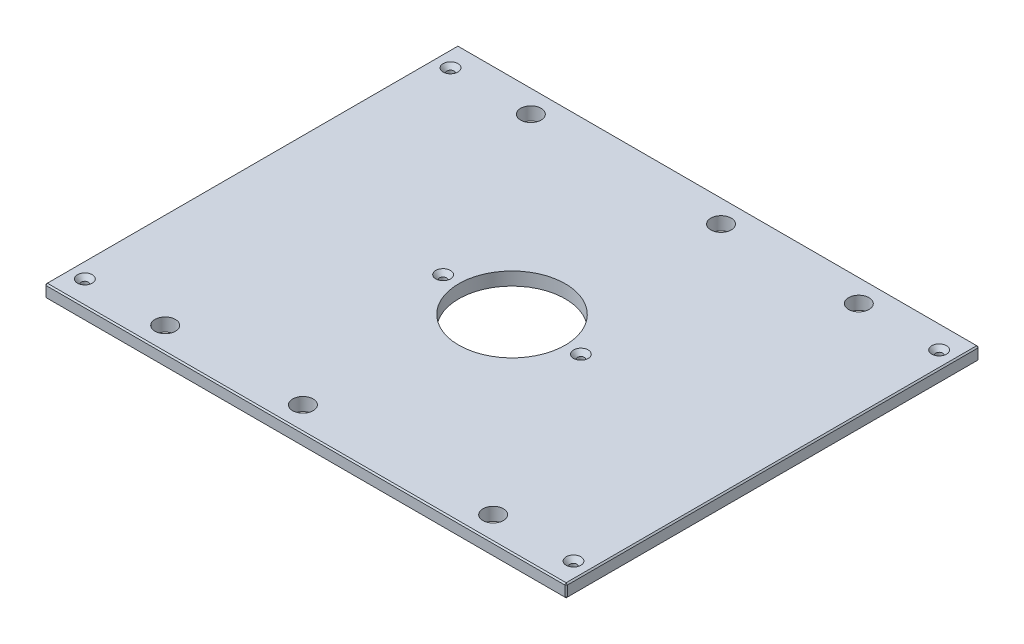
from build123d import *

# Parameters (mm, degrees)
SKETCH1_W                                        = 504.825
SKETCH1_H                                        = 400.05
BOSS_EXTRUDE1_DEPTH                              = 12.7
SKETCH13_R                                       = 51.562
CUT_EXTRUDE6_DEPTH                               = 323.309417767
F_25_32_0_78125_DIAMETER_HOLE1_D                 = 19.84375
CHAMFER2_SIZE                                    = 1.27
CSK_FOR_1_4_FLAT_HEAD_MACHINE_SCREW1_D           = 6.7564
CSK_FOR_1_4_FLAT_HEAD_MACHINE_SCREW1_CSINK_D     = 14.2748
CSK_FOR_1_4_FLAT_HEAD_MACHINE_SCREW1_CSINK_ANGLE = 82


with BuildPart() as part:
    # Sketch1 → Boss-Extrude1 (new body)
    with BuildSketch(Plane(origin=(0, 0, 0), x_dir=(1, 0, 0), z_dir=(0, 1, 0))):
        Rectangle(SKETCH1_W, SKETCH1_H)
    extrude(amount=BOSS_EXTRUDE1_DEPTH)

    # Sketch13 → Cut-Extrude6 (cut, through all)
    with BuildSketch(Plane(origin=(0, 12.7, 0), x_dir=(1, 0, 0), z_dir=(0, 1, 0))):
        with Locations(Location((0, 0, 0), (0, 0, 270))):
            Circle(SKETCH13_R)
    extrude(amount=-CUT_EXTRUDE6_DEPTH, mode=Mode.SUBTRACT)

    # 25_32 _0.78125_ Diameter Hole1 (through all)
    with Locations(Plane(origin=(0, 12.7, 0), x_dir=(1, 0, 0), z_dir=(0, 1, 0))):
        with Locations((158.75, 177.00498), (-158.75, 177.00498), (158.75, -177.00498), (-158.75, -177.00498), (25.4, 177.00498), (-25.4, -177.00498)):
            Hole(F_25_32_0_78125_DIAMETER_HOLE1_D / 2)

    # Chamfer2
    chamfer2_edges = [part.edges().sort_by_distance(p)[0] for p in [
        (252.4125, 12.7, 0),
        (0, 12.7, -200.025),
        (-252.4125, 12.7, 0),
        (0, 0, -200.025),
        (252.4125, 0, 0),
        (0, 0, 200.025),
        (-252.4125, 0, 0),
        (0, 12.7, 200.025),
        (-252.4125, 6.35, -200.025),
        (252.4125, 6.35, -200.025),
        (252.4125, 6.35, 200.025),
        (-252.4125, 6.35, 200.025),
    ]]
    chamfer(chamfer2_edges, length=CHAMFER2_SIZE)

    # CSK for 1_4 Flat Head Machine Screw1 (through all)
    with Locations(Plane(origin=(0, 12.7, 0), x_dir=(1, 0, 0), z_dir=(0, 1, 0))):
        with Locations((236.5375, 177.00498), (236.5375, -177.00498), (-236.5375, -177.00498), (-66.675, 0), (66.675, 0), (-236.5375, 177.00498), (-158.75, 177.00498), (-158.75, -177.00498)):
            CounterSinkHole(CSK_FOR_1_4_FLAT_HEAD_MACHINE_SCREW1_D / 2, CSK_FOR_1_4_FLAT_HEAD_MACHINE_SCREW1_CSINK_D / 2, counter_sink_angle=CSK_FOR_1_4_FLAT_HEAD_MACHINE_SCREW1_CSINK_ANGLE)


solid = part.part
